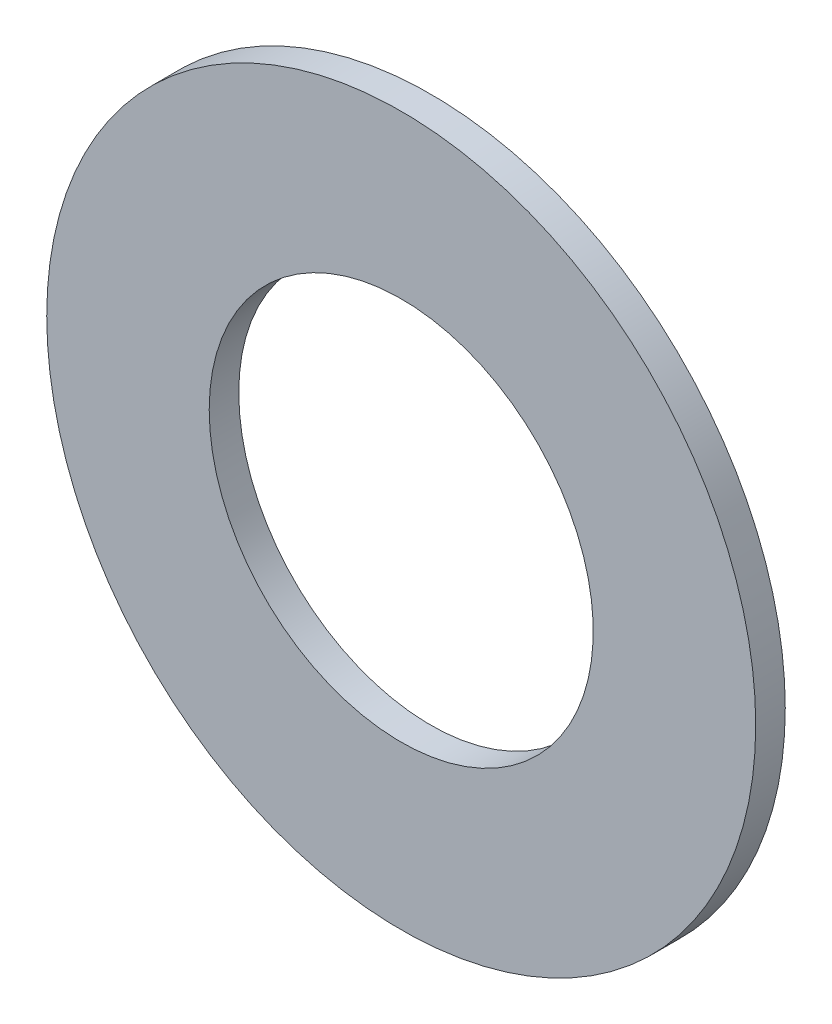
from build123d import *

# Parameters (mm, degrees)
ESQUISSE1_R      = 6
ESQUISSE1_R_2    = 3.25
EXTRUSION1_DEPTH = 0.5


with BuildPart() as part:
    # Esquisse1 → Extrusion1 (new body)
    with BuildSketch(Plane.XY):
        with Locations(Location((0, 0, 0), (0, 0, 180))):
            Circle(ESQUISSE1_R)
        with Locations(Location((0, 0, 0), (0, 0, 180))):
            Circle(ESQUISSE1_R_2, mode=Mode.SUBTRACT)
    extrude(amount=EXTRUSION1_DEPTH)


solid = part.part
